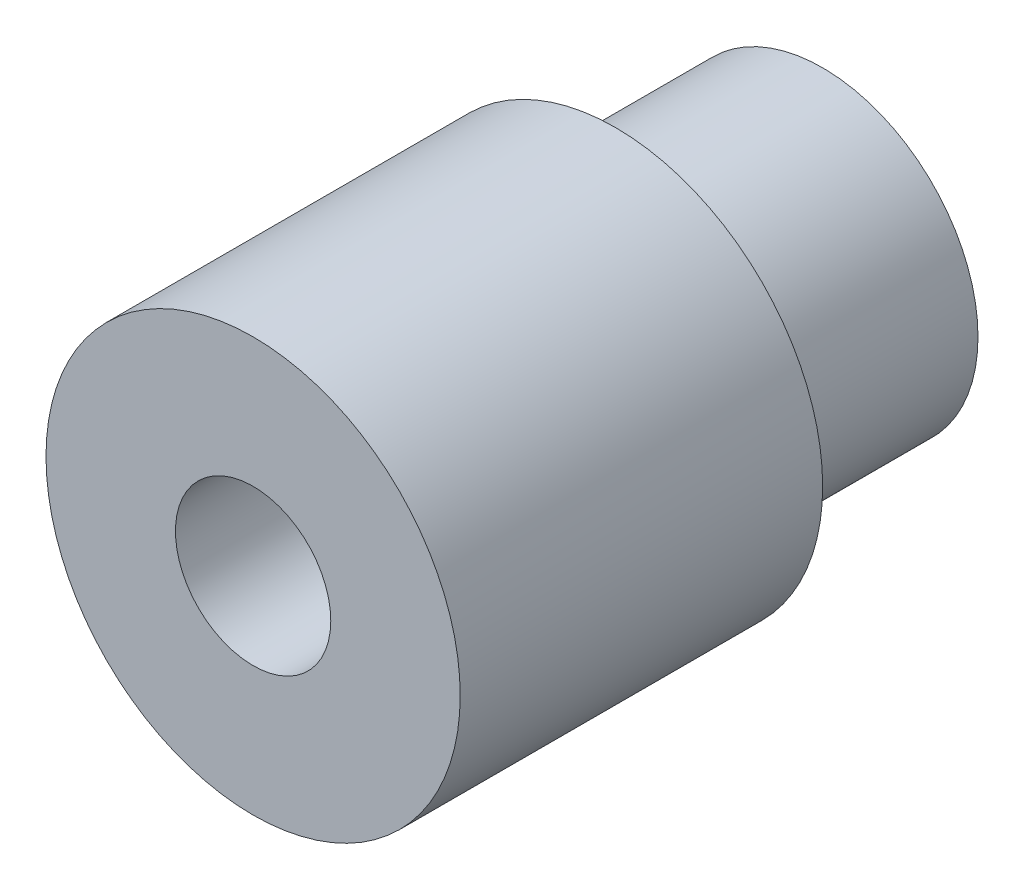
ISO-10303-21;
HEADER;
FILE_DESCRIPTION(('STEP AP214'),'2;1');
FILE_NAME('part.step','',(''),(''),'','','');
FILE_SCHEMA(('AUTOMOTIVE_DESIGN { 1 0 10303 214 1 1 1 1 }'));
ENDSEC;
DATA;
#1=APPLICATION_CONTEXT('core data for automotive mechanical design processes');
#2=APPLICATION_PROTOCOL_DEFINITION('international standard','automotive_design',2000,#1);
#3=PRODUCT_CONTEXT('',#1,'mechanical');
#4=PRODUCT('Part','Part','',(#3));
#5=PRODUCT_RELATED_PRODUCT_CATEGORY('part','',(#4));
#6=PRODUCT_DEFINITION_FORMATION('','',#4);
#7=PRODUCT_DEFINITION_CONTEXT('part definition',#1,'design');
#8=PRODUCT_DEFINITION('design','',#6,#7);
#9=PRODUCT_DEFINITION_SHAPE('','',#8);
#10=(LENGTH_UNIT() NAMED_UNIT(*) SI_UNIT(.MILLI.,.METRE.));
#11=(NAMED_UNIT(*) PLANE_ANGLE_UNIT() SI_UNIT($,.RADIAN.));
#12=(NAMED_UNIT(*) SI_UNIT($,.STERADIAN.) SOLID_ANGLE_UNIT());
#13=UNCERTAINTY_MEASURE_WITH_UNIT(LENGTH_MEASURE(1.E-05),#10,'distance_accuracy_value','');
#14=(GEOMETRIC_REPRESENTATION_CONTEXT(3) GLOBAL_UNCERTAINTY_ASSIGNED_CONTEXT((#13)) GLOBAL_UNIT_ASSIGNED_CONTEXT((#10,
#11,#12)) REPRESENTATION_CONTEXT('',''));
#15=CARTESIAN_POINT('',(0.,0.,0.));
#16=DIRECTION('',(0.,0.,1.));
#17=DIRECTION('',(1.,0.,0.));
#18=AXIS2_PLACEMENT_3D('',#15,#16,#17);
#19=CARTESIAN_POINT('',(0.,0.,0.));
#20=DIRECTION('',(0.,0.,1.));
#21=DIRECTION('',(1.,0.,0.));
#22=AXIS2_PLACEMENT_3D('',#19,#20,#21);
#23=PLANE('',#22);
#24=CARTESIAN_POINT('',(0.,0.,0.));
#25=DIRECTION('',(0.,0.,1.));
#26=DIRECTION('',(1.,0.,0.));
#27=AXIS2_PLACEMENT_3D('',#24,#25,#26);
#28=CIRCLE('',#27,8.);
#29=CARTESIAN_POINT('',(-8.00000000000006,0.,0.));
#30=VERTEX_POINT('',#29);
#31=EDGE_CURVE('E39',#30,#30,#28,.T.);
#32=ORIENTED_EDGE('',*,*,#31,.F.);
#33=EDGE_LOOP('',(#32));
#34=FACE_BOUND('',#33,.T.);
#35=CARTESIAN_POINT('',(0.,0.,0.));
#36=DIRECTION('',(0.,0.,1.));
#37=DIRECTION('',(1.,0.,0.));
#38=AXIS2_PLACEMENT_3D('',#35,#36,#37);
#39=CIRCLE('',#38,6.);
#40=CARTESIAN_POINT('',(5.99999999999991,0.,0.));
#41=VERTEX_POINT('',#40);
#42=EDGE_CURVE('E10',#41,#41,#39,.F.);
#43=ORIENTED_EDGE('',*,*,#42,.F.);
#44=EDGE_LOOP('',(#43));
#45=FACE_BOUND('',#44,.T.);
#46=ADVANCED_FACE('F28',(#34,#45),#23,.F.);
#47=CARTESIAN_POINT('',(0.,0.,14.));
#48=DIRECTION('',(0.,0.,-1.));
#49=DIRECTION('',(-1.,0.,0.));
#50=AXIS2_PLACEMENT_3D('',#47,#48,#49);
#51=CYLINDRICAL_SURFACE('',#50,8.);
#52=CARTESIAN_POINT('',(0.,0.,14.));
#53=DIRECTION('',(0.,0.,1.));
#54=DIRECTION('',(1.,0.,0.));
#55=AXIS2_PLACEMENT_3D('',#52,#53,#54);
#56=CIRCLE('',#55,8.);
#57=CARTESIAN_POINT('',(-8.00000000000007,0.,14.));
#58=VERTEX_POINT('',#57);
#59=EDGE_CURVE('E35',#58,#58,#56,.T.);
#60=CARTESIAN_POINT('',(-8.00000000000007,0.,14.));
#61=CARTESIAN_POINT('',(-8.00000000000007,0.,13.8541666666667));
#62=CARTESIAN_POINT('',(-8.00000000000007,0.,13.7083333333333));
#63=CARTESIAN_POINT('',(-8.00000000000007,0.,13.4166666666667));
#64=CARTESIAN_POINT('',(-8.00000000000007,0.,13.2708333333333));
#65=CARTESIAN_POINT('',(-8.00000000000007,0.,12.9791666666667));
#66=CARTESIAN_POINT('',(-8.00000000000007,0.,12.8333333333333));
#67=CARTESIAN_POINT('',(-8.00000000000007,0.,12.5416666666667));
#68=CARTESIAN_POINT('',(-8.00000000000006,0.,12.3958333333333));
#69=CARTESIAN_POINT('',(-8.00000000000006,0.,12.1041666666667));
#70=CARTESIAN_POINT('',(-8.00000000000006,0.,11.9583333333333));
#71=CARTESIAN_POINT('',(-8.00000000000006,0.,11.6666666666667));
#72=CARTESIAN_POINT('',(-8.00000000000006,0.,11.5208333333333));
#73=CARTESIAN_POINT('',(-8.00000000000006,0.,11.2291666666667));
#74=CARTESIAN_POINT('',(-8.00000000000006,0.,11.0833333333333));
#75=CARTESIAN_POINT('',(-8.00000000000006,0.,10.7916666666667));
#76=CARTESIAN_POINT('',(-8.00000000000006,0.,10.6458333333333));
#77=CARTESIAN_POINT('',(-8.00000000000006,0.,10.3541666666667));
#78=CARTESIAN_POINT('',(-8.00000000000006,0.,10.2083333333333));
#79=CARTESIAN_POINT('',(-8.00000000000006,0.,9.91666666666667));
#80=CARTESIAN_POINT('',(-8.00000000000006,0.,9.77083333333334));
#81=CARTESIAN_POINT('',(-8.00000000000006,0.,9.47916666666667));
#82=CARTESIAN_POINT('',(-8.00000000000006,0.,9.33333333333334));
#83=CARTESIAN_POINT('',(-8.00000000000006,0.,9.04166666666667));
#84=CARTESIAN_POINT('',(-8.00000000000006,0.,8.89583333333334));
#85=CARTESIAN_POINT('',(-8.00000000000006,0.,8.60416666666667));
#86=CARTESIAN_POINT('',(-8.00000000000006,0.,8.45833333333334));
#87=CARTESIAN_POINT('',(-8.00000000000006,0.,8.16666666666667));
#88=CARTESIAN_POINT('',(-8.00000000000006,0.,8.02083333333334));
#89=CARTESIAN_POINT('',(-8.00000000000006,0.,7.72916666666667));
#90=CARTESIAN_POINT('',(-8.00000000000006,0.,7.58333333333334));
#91=CARTESIAN_POINT('',(-8.00000000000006,0.,7.29166666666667));
#92=CARTESIAN_POINT('',(-8.00000000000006,0.,7.14583333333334));
#93=CARTESIAN_POINT('',(-8.00000000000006,0.,6.85416666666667));
#94=CARTESIAN_POINT('',(-8.00000000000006,0.,6.70833333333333));
#95=CARTESIAN_POINT('',(-8.00000000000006,0.,6.41666666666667));
#96=CARTESIAN_POINT('',(-8.00000000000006,0.,6.27083333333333));
#97=CARTESIAN_POINT('',(-8.00000000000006,0.,5.97916666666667));
#98=CARTESIAN_POINT('',(-8.00000000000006,0.,5.83333333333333));
#99=CARTESIAN_POINT('',(-8.00000000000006,0.,5.54166666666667));
#100=CARTESIAN_POINT('',(-8.00000000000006,0.,5.39583333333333));
#101=CARTESIAN_POINT('',(-8.00000000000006,0.,5.10416666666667));
#102=CARTESIAN_POINT('',(-8.00000000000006,0.,4.95833333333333));
#103=CARTESIAN_POINT('',(-8.00000000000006,0.,4.66666666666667));
#104=CARTESIAN_POINT('',(-8.00000000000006,0.,4.52083333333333));
#105=CARTESIAN_POINT('',(-8.00000000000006,0.,4.22916666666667));
#106=CARTESIAN_POINT('',(-8.00000000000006,0.,4.08333333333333));
#107=CARTESIAN_POINT('',(-8.00000000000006,0.,3.79166666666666));
#108=CARTESIAN_POINT('',(-8.00000000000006,0.,3.64583333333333));
#109=CARTESIAN_POINT('',(-8.00000000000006,0.,3.35416666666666));
#110=CARTESIAN_POINT('',(-8.00000000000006,0.,3.20833333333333));
#111=CARTESIAN_POINT('',(-8.00000000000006,0.,2.91666666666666));
#112=CARTESIAN_POINT('',(-8.00000000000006,0.,2.77083333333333));
#113=CARTESIAN_POINT('',(-8.00000000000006,0.,2.47916666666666));
#114=CARTESIAN_POINT('',(-8.00000000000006,0.,2.33333333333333));
#115=CARTESIAN_POINT('',(-8.00000000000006,0.,2.04166666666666));
#116=CARTESIAN_POINT('',(-8.00000000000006,0.,1.89583333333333));
#117=CARTESIAN_POINT('',(-8.00000000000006,0.,1.60416666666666));
#118=CARTESIAN_POINT('',(-8.00000000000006,0.,1.45833333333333));
#119=CARTESIAN_POINT('',(-8.00000000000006,0.,1.16666666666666));
#120=CARTESIAN_POINT('',(-8.00000000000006,0.,1.02083333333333));
#121=CARTESIAN_POINT('',(-8.00000000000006,0.,0.729166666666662));
#122=CARTESIAN_POINT('',(-8.00000000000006,0.,0.583333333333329));
#123=CARTESIAN_POINT('',(-8.00000000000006,0.,0.291666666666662));
#124=CARTESIAN_POINT('',(-8.00000000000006,0.,0.145833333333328));
#125=CARTESIAN_POINT('',(-8.00000000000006,0.,0.));
#126=B_SPLINE_CURVE_WITH_KNOTS('',3,(#60,#61,#62,#63,#64,#65,#66,#67,#68,#69,#70,#71,#72,#73,
#74,#75,#76,#77,#78,#79,#80,#81,#82,#83,#84,#85,#86,#87,#88,#89,#90,#91,#92,#93,#94,#95,#96,#97,
#98,#99,#100,#101,#102,#103,#104,#105,#106,#107,#108,#109,#110,#111,#112,#113,#114,#115,#116,
#117,#118,#119,#120,#121,#122,#123,#124,#125),.UNSPECIFIED.,.F.,.F.,(4,2,2,2,2,2,2,2,2,2,2,2,2,
2,2,2,2,2,2,2,2,2,2,2,2,2,2,2,2,2,2,2,4),(0.,0.437499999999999,0.874999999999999,1.3125,1.75,
2.1875,2.625,3.0625,3.5,3.9375,4.375,4.8125,5.25,5.68750000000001,6.125,6.56250000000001,
7.00000000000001,7.43750000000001,7.87500000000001,8.31250000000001,8.75000000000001,
9.18750000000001,9.62500000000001,10.0625,10.5,10.9375,11.375,11.8125,12.25,12.6875,13.125,
13.5625,14.),.UNSPECIFIED.);
#127=EDGE_CURVE('BSEAM30',#58,#30,#126,.T.);
#128=ORIENTED_EDGE('',*,*,#59,.F.);
#129=ORIENTED_EDGE('',*,*,#31,.T.);
#130=ORIENTED_EDGE('',*,*,#127,.T.);
#131=ORIENTED_EDGE('',*,*,#127,.F.);
#132=EDGE_LOOP('',(#128,#130,#129,#131));
#133=FACE_BOUND('',#132,.T.);
#134=ADVANCED_FACE('F30',(#133),#51,.T.);
#135=CARTESIAN_POINT('',(0.,0.,14.));
#136=DIRECTION('',(0.,0.,1.));
#137=DIRECTION('',(1.,0.,0.));
#138=AXIS2_PLACEMENT_3D('',#135,#136,#137);
#139=PLANE('',#138);
#140=CARTESIAN_POINT('',(0.,0.,14.));
#141=DIRECTION('',(0.,0.,1.));
#142=DIRECTION('',(1.,0.,0.));
#143=AXIS2_PLACEMENT_3D('',#140,#141,#142);
#144=CIRCLE('',#143,3.);
#145=CARTESIAN_POINT('',(2.99999999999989,0.,14.));
#146=VERTEX_POINT('',#145);
#147=EDGE_CURVE('E51',#146,#146,#144,.T.);
#148=ORIENTED_EDGE('',*,*,#147,.F.);
#149=EDGE_LOOP('',(#148));
#150=FACE_BOUND('',#149,.T.);
#151=ORIENTED_EDGE('',*,*,#59,.T.);
#152=EDGE_LOOP('',(#151));
#153=FACE_BOUND('',#152,.T.);
#154=ADVANCED_FACE('F57',(#150,#153),#139,.T.);
#155=CARTESIAN_POINT('',(-1.00613961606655E-13,0.,-8.00000000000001));
#156=DIRECTION('',(0.,0.,1.));
#157=DIRECTION('',(1.,0.,0.));
#158=AXIS2_PLACEMENT_3D('',#155,#156,#157);
#159=CYLINDRICAL_SURFACE('',#158,6.);
#160=CARTESIAN_POINT('',(-1.00613961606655E-13,0.,-8.00000000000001));
#161=DIRECTION('',(0.,0.,-1.));
#162=DIRECTION('',(-1.,0.,0.));
#163=AXIS2_PLACEMENT_3D('',#160,#161,#162);
#164=CIRCLE('',#163,6.);
#165=CARTESIAN_POINT('',(5.99999999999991,0.,-8.00000000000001));
#166=VERTEX_POINT('',#165);
#167=EDGE_CURVE('E43',#166,#166,#164,.T.);
#168=CARTESIAN_POINT('',(5.99999999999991,0.,-8.00000000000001));
#169=CARTESIAN_POINT('',(5.99999999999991,0.,-7.91666666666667));
#170=CARTESIAN_POINT('',(5.99999999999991,0.,-7.83333333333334));
#171=CARTESIAN_POINT('',(5.99999999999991,0.,-7.66666666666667));
#172=CARTESIAN_POINT('',(5.99999999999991,0.,-7.58333333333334));
#173=CARTESIAN_POINT('',(5.99999999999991,0.,-7.41666666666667));
#174=CARTESIAN_POINT('',(5.99999999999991,0.,-7.33333333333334));
#175=CARTESIAN_POINT('',(5.99999999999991,0.,-7.16666666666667));
#176=CARTESIAN_POINT('',(5.99999999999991,0.,-7.08333333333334));
#177=CARTESIAN_POINT('',(5.99999999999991,0.,-6.91666666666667));
#178=CARTESIAN_POINT('',(5.99999999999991,0.,-6.83333333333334));
#179=CARTESIAN_POINT('',(5.99999999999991,0.,-6.66666666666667));
#180=CARTESIAN_POINT('',(5.99999999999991,0.,-6.58333333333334));
#181=CARTESIAN_POINT('',(5.99999999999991,0.,-6.41666666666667));
#182=CARTESIAN_POINT('',(5.99999999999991,0.,-6.33333333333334));
#183=CARTESIAN_POINT('',(5.99999999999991,0.,-6.16666666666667));
#184=CARTESIAN_POINT('',(5.99999999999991,0.,-6.08333333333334));
#185=CARTESIAN_POINT('',(5.99999999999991,0.,-5.91666666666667));
#186=CARTESIAN_POINT('',(5.99999999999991,0.,-5.83333333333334));
#187=CARTESIAN_POINT('',(5.99999999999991,0.,-5.66666666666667));
#188=CARTESIAN_POINT('',(5.99999999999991,0.,-5.58333333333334));
#189=CARTESIAN_POINT('',(5.99999999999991,0.,-5.41666666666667));
#190=CARTESIAN_POINT('',(5.99999999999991,0.,-5.33333333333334));
#191=CARTESIAN_POINT('',(5.99999999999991,0.,-5.16666666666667));
#192=CARTESIAN_POINT('',(5.99999999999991,0.,-5.08333333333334));
#193=CARTESIAN_POINT('',(5.99999999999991,0.,-4.91666666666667));
#194=CARTESIAN_POINT('',(5.99999999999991,0.,-4.83333333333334));
#195=CARTESIAN_POINT('',(5.99999999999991,0.,-4.66666666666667));
#196=CARTESIAN_POINT('',(5.99999999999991,0.,-4.58333333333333));
#197=CARTESIAN_POINT('',(5.99999999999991,0.,-4.41666666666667));
#198=CARTESIAN_POINT('',(5.99999999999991,0.,-4.33333333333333));
#199=CARTESIAN_POINT('',(5.99999999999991,0.,-4.16666666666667));
#200=CARTESIAN_POINT('',(5.99999999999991,0.,-4.08333333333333));
#201=CARTESIAN_POINT('',(5.99999999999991,0.,-3.91666666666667));
#202=CARTESIAN_POINT('',(5.99999999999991,0.,-3.83333333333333));
#203=CARTESIAN_POINT('',(5.99999999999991,0.,-3.66666666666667));
#204=CARTESIAN_POINT('',(5.99999999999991,0.,-3.58333333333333));
#205=CARTESIAN_POINT('',(5.99999999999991,0.,-3.41666666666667));
#206=CARTESIAN_POINT('',(5.99999999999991,0.,-3.33333333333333));
#207=CARTESIAN_POINT('',(5.99999999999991,0.,-3.16666666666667));
#208=CARTESIAN_POINT('',(5.99999999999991,0.,-3.08333333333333));
#209=CARTESIAN_POINT('',(5.99999999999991,0.,-2.91666666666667));
#210=CARTESIAN_POINT('',(5.99999999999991,0.,-2.83333333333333));
#211=CARTESIAN_POINT('',(5.99999999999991,0.,-2.66666666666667));
#212=CARTESIAN_POINT('',(5.99999999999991,0.,-2.58333333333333));
#213=CARTESIAN_POINT('',(5.99999999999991,0.,-2.41666666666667));
#214=CARTESIAN_POINT('',(5.99999999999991,0.,-2.33333333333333));
#215=CARTESIAN_POINT('',(5.99999999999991,0.,-2.16666666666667));
#216=CARTESIAN_POINT('',(5.99999999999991,0.,-2.08333333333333));
#217=CARTESIAN_POINT('',(5.99999999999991,0.,-1.91666666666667));
#218=CARTESIAN_POINT('',(5.99999999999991,0.,-1.83333333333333));
#219=CARTESIAN_POINT('',(5.99999999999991,0.,-1.66666666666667));
#220=CARTESIAN_POINT('',(5.99999999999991,0.,-1.58333333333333));
#221=CARTESIAN_POINT('',(5.99999999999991,0.,-1.41666666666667));
#222=CARTESIAN_POINT('',(5.99999999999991,0.,-1.33333333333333));
#223=CARTESIAN_POINT('',(5.99999999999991,0.,-1.16666666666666));
#224=CARTESIAN_POINT('',(5.99999999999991,0.,-1.08333333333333));
#225=CARTESIAN_POINT('',(5.99999999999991,0.,-0.916666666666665));
#226=CARTESIAN_POINT('',(5.99999999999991,0.,-0.833333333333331));
#227=CARTESIAN_POINT('',(5.99999999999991,0.,-0.666666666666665));
#228=CARTESIAN_POINT('',(5.99999999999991,0.,-0.583333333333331));
#229=CARTESIAN_POINT('',(5.99999999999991,0.,-0.416666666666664));
#230=CARTESIAN_POINT('',(5.99999999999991,0.,-0.333333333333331));
#231=CARTESIAN_POINT('',(5.99999999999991,0.,-0.166666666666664));
#232=CARTESIAN_POINT('',(5.99999999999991,0.,-0.0833333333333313));
#233=CARTESIAN_POINT('',(5.99999999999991,0.,0.));
#234=B_SPLINE_CURVE_WITH_KNOTS('',3,(#168,#169,#170,#171,#172,#173,#174,#175,#176,#177,#178,
#179,#180,#181,#182,#183,#184,#185,#186,#187,#188,#189,#190,#191,#192,#193,#194,#195,#196,#197,
#198,#199,#200,#201,#202,#203,#204,#205,#206,#207,#208,#209,#210,#211,#212,#213,#214,#215,#216,
#217,#218,#219,#220,#221,#222,#223,#224,#225,#226,#227,#228,#229,#230,#231,#232,#233),
.UNSPECIFIED.,.F.,.F.,(4,2,2,2,2,2,2,2,2,2,2,2,2,2,2,2,2,2,2,2,2,2,2,2,2,2,2,2,2,2,2,2,4),(0.,
0.250000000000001,0.500000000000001,0.750000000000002,1.,1.25,1.5,1.75,2.,2.25,2.5,2.75,3.,3.25,
3.5,3.75,4.,4.25,4.5,4.75000000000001,5.00000000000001,5.25000000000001,5.50000000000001,
5.75000000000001,6.00000000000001,6.25000000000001,6.50000000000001,6.75000000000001,
7.00000000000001,7.25000000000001,7.50000000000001,7.75000000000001,8.00000000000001),.UNSPECIFIED.);
#235=EDGE_CURVE('BSEAM59',#166,#41,#234,.T.);
#236=ORIENTED_EDGE('',*,*,#167,.F.);
#237=ORIENTED_EDGE('',*,*,#42,.T.);
#238=ORIENTED_EDGE('',*,*,#235,.T.);
#239=ORIENTED_EDGE('',*,*,#235,.F.);
#240=EDGE_LOOP('',(#236,#238,#237,#239));
#241=FACE_BOUND('',#240,.T.);
#242=ADVANCED_FACE('F59',(#241),#159,.T.);
#243=CARTESIAN_POINT('',(-1.00613961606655E-13,0.,-8.00000000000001));
#244=DIRECTION('',(0.,0.,-1.));
#245=DIRECTION('',(-1.,0.,0.));
#246=AXIS2_PLACEMENT_3D('',#243,#244,#245);
#247=PLANE('',#246);
#248=CARTESIAN_POINT('',(-1.00613961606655E-13,0.,-8.00000000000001));
#249=DIRECTION('',(0.,0.,1.));
#250=DIRECTION('',(1.,0.,0.));
#251=AXIS2_PLACEMENT_3D('',#248,#249,#250);
#252=CIRCLE('',#251,3.);
#253=CARTESIAN_POINT('',(2.9999999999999,0.,-8.00000000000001));
#254=VERTEX_POINT('',#253);
#255=EDGE_CURVE('E48',#254,#254,#252,.T.);
#256=ORIENTED_EDGE('',*,*,#255,.T.);
#257=EDGE_LOOP('',(#256));
#258=FACE_BOUND('',#257,.T.);
#259=ORIENTED_EDGE('',*,*,#167,.T.);
#260=EDGE_LOOP('',(#259));
#261=FACE_BOUND('',#260,.T.);
#262=ADVANCED_FACE('F64',(#258,#261),#247,.T.);
#263=CARTESIAN_POINT('',(-1.00613961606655E-13,0.,-8.00000000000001));
#264=DIRECTION('',(0.,0.,1.));
#265=DIRECTION('',(1.,0.,0.));
#266=AXIS2_PLACEMENT_3D('',#263,#264,#265);
#267=CYLINDRICAL_SURFACE('',#266,3.);
#268=CARTESIAN_POINT('',(2.9999999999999,0.,-8.00000000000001));
#269=CARTESIAN_POINT('',(2.9999999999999,0.,-7.77083333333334));
#270=CARTESIAN_POINT('',(2.9999999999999,0.,-7.54166666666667));
#271=CARTESIAN_POINT('',(2.9999999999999,0.,-7.08333333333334));
#272=CARTESIAN_POINT('',(2.9999999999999,0.,-6.85416666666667));
#273=CARTESIAN_POINT('',(2.9999999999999,0.,-6.39583333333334));
#274=CARTESIAN_POINT('',(2.9999999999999,0.,-6.16666666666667));
#275=CARTESIAN_POINT('',(2.9999999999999,0.,-5.70833333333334));
#276=CARTESIAN_POINT('',(2.9999999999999,0.,-5.47916666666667));
#277=CARTESIAN_POINT('',(2.9999999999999,0.,-5.02083333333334));
#278=CARTESIAN_POINT('',(2.9999999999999,0.,-4.79166666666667));
#279=CARTESIAN_POINT('',(2.9999999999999,0.,-4.33333333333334));
#280=CARTESIAN_POINT('',(2.9999999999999,0.,-4.10416666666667));
#281=CARTESIAN_POINT('',(2.9999999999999,0.,-3.64583333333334));
#282=CARTESIAN_POINT('',(2.9999999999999,0.,-3.41666666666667));
#283=CARTESIAN_POINT('',(2.9999999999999,0.,-2.95833333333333));
#284=CARTESIAN_POINT('',(2.9999999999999,0.,-2.72916666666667));
#285=CARTESIAN_POINT('',(2.9999999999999,0.,-2.27083333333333));
#286=CARTESIAN_POINT('',(2.9999999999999,0.,-2.04166666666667));
#287=CARTESIAN_POINT('',(2.9999999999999,0.,-1.58333333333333));
#288=CARTESIAN_POINT('',(2.9999999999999,0.,-1.35416666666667));
#289=CARTESIAN_POINT('',(2.9999999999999,0.,-0.895833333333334));
#290=CARTESIAN_POINT('',(2.9999999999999,0.,-0.666666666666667));
#291=CARTESIAN_POINT('',(2.9999999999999,0.,-0.208333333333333));
#292=CARTESIAN_POINT('',(2.9999999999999,0.,0.0208333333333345));
#293=CARTESIAN_POINT('',(2.9999999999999,0.,0.479166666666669));
#294=CARTESIAN_POINT('',(2.9999999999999,0.,0.708333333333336));
#295=CARTESIAN_POINT('',(2.9999999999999,0.,1.16666666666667));
#296=CARTESIAN_POINT('',(2.9999999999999,0.,1.39583333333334));
#297=CARTESIAN_POINT('',(2.9999999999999,0.,1.85416666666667));
#298=CARTESIAN_POINT('',(2.9999999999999,0.,2.08333333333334));
#299=CARTESIAN_POINT('',(2.9999999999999,0.,2.54166666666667));
#300=CARTESIAN_POINT('',(2.9999999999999,0.,2.77083333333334));
#301=CARTESIAN_POINT('',(2.9999999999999,0.,3.22916666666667));
#302=CARTESIAN_POINT('',(2.9999999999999,0.,3.45833333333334));
#303=CARTESIAN_POINT('',(2.9999999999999,0.,3.91666666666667));
#304=CARTESIAN_POINT('',(2.9999999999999,0.,4.14583333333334));
#305=CARTESIAN_POINT('',(2.9999999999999,0.,4.60416666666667));
#306=CARTESIAN_POINT('',(2.9999999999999,0.,4.83333333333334));
#307=CARTESIAN_POINT('',(2.9999999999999,0.,5.29166666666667));
#308=CARTESIAN_POINT('',(2.9999999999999,0.,5.52083333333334));
#309=CARTESIAN_POINT('',(2.9999999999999,0.,5.97916666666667));
#310=CARTESIAN_POINT('',(2.9999999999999,0.,6.20833333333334));
#311=CARTESIAN_POINT('',(2.9999999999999,0.,6.66666666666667));
#312=CARTESIAN_POINT('',(2.9999999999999,0.,6.89583333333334));
#313=CARTESIAN_POINT('',(2.9999999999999,0.,7.35416666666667));
#314=CARTESIAN_POINT('',(2.9999999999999,0.,7.58333333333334));
#315=CARTESIAN_POINT('',(2.9999999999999,0.,8.04166666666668));
#316=CARTESIAN_POINT('',(2.9999999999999,0.,8.27083333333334));
#317=CARTESIAN_POINT('',(2.9999999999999,0.,8.72916666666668));
#318=CARTESIAN_POINT('',(2.9999999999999,0.,8.95833333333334));
#319=CARTESIAN_POINT('',(2.9999999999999,0.,9.41666666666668));
#320=CARTESIAN_POINT('',(2.9999999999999,0.,9.64583333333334));
#321=CARTESIAN_POINT('',(2.9999999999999,0.,10.1041666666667));
#322=CARTESIAN_POINT('',(2.99999999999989,0.,10.3333333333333));
#323=CARTESIAN_POINT('',(2.99999999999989,0.,10.7916666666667));
#324=CARTESIAN_POINT('',(2.99999999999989,0.,11.0208333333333));
#325=CARTESIAN_POINT('',(2.99999999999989,0.,11.4791666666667));
#326=CARTESIAN_POINT('',(2.99999999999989,0.,11.7083333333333));
#327=CARTESIAN_POINT('',(2.99999999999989,0.,12.1666666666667));
#328=CARTESIAN_POINT('',(2.99999999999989,0.,12.3958333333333));
#329=CARTESIAN_POINT('',(2.99999999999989,0.,12.8541666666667));
#330=CARTESIAN_POINT('',(2.99999999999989,0.,13.0833333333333));
#331=CARTESIAN_POINT('',(2.99999999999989,0.,13.5416666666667));
#332=CARTESIAN_POINT('',(2.99999999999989,0.,13.7708333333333));
#333=CARTESIAN_POINT('',(2.99999999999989,0.,14.));
#334=B_SPLINE_CURVE_WITH_KNOTS('',3,(#268,#269,#270,#271,#272,#273,#274,#275,#276,#277,#278,
#279,#280,#281,#282,#283,#284,#285,#286,#287,#288,#289,#290,#291,#292,#293,#294,#295,#296,#297,
#298,#299,#300,#301,#302,#303,#304,#305,#306,#307,#308,#309,#310,#311,#312,#313,#314,#315,#316,
#317,#318,#319,#320,#321,#322,#323,#324,#325,#326,#327,#328,#329,#330,#331,#332,#333),
.UNSPECIFIED.,.F.,.F.,(4,2,2,2,2,2,2,2,2,2,2,2,2,2,2,2,2,2,2,2,2,2,2,2,2,2,2,2,2,2,2,2,4),(0.,
0.6875,1.375,2.0625,2.75,3.4375,4.125,4.8125,5.5,6.1875,6.875,7.56250000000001,8.25000000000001,
8.93750000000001,9.62500000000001,10.3125,11.,11.6875,12.375,13.0625,13.75,14.4375,15.125,
15.8125,16.5,17.1875,17.875,18.5625,19.25,19.9375,20.625,21.3125,22.),.UNSPECIFIED.);
#335=EDGE_CURVE('BSEAM55',#254,#146,#334,.T.);
#336=ORIENTED_EDGE('',*,*,#255,.F.);
#337=ORIENTED_EDGE('',*,*,#147,.T.);
#338=ORIENTED_EDGE('',*,*,#335,.T.);
#339=ORIENTED_EDGE('',*,*,#335,.F.);
#340=EDGE_LOOP('',(#336,#338,#337,#339));
#341=FACE_BOUND('',#340,.T.);
#342=ADVANCED_FACE('F55',(#341),#267,.F.);
#343=CLOSED_SHELL('',(#46,#134,#154,#242,#262,#342));
#344=MANIFOLD_SOLID_BREP('B2',#343);
#345=ADVANCED_BREP_SHAPE_REPRESENTATION('',(#18,#344),#14);
#346=SHAPE_DEFINITION_REPRESENTATION(#9,#345);
ENDSEC;
END-ISO-10303-21;
